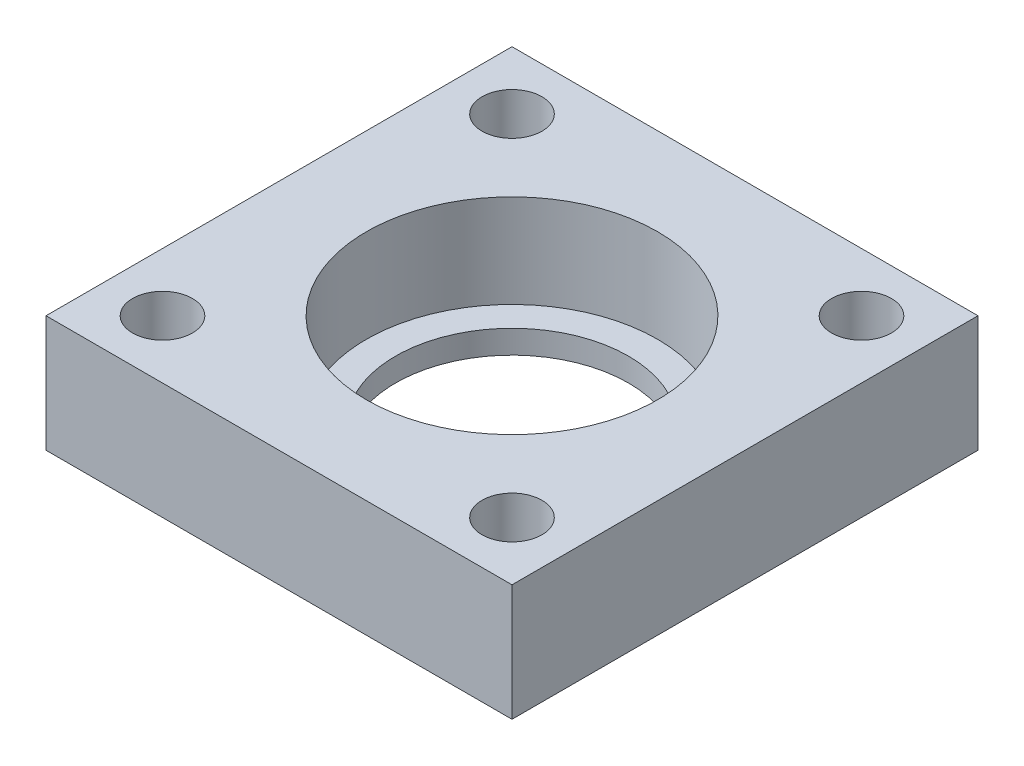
from build123d import *

# Parameters (mm, degrees)
SKETCH1_W         = 25.4
SKETCH1_H         = 25.4
EXTRUDE1_DEPTH    = 6.35
SKETCH2_R         = 7.9375
EXTRUDE2_DEPTH    = 5.08
SKETCH3_R         = 6.35
EXTRUDE3_DEPTH    = 1.27
CIRPATTERN1_COUNT = 4


with BuildPart() as part:
    # Sketch1 → Extrude1 (new body)
    with BuildSketch(Plane(origin=(0, 0, 0), x_dir=(1, 0, 0), z_dir=(0, 1, 0))):
        with Locations((12.7, 12.7)):
            Rectangle(SKETCH1_W, SKETCH1_H)
    extrude(amount=-EXTRUDE1_DEPTH)

    # Sketch2 → Extrude2 (cut)
    with BuildSketch(Plane(origin=(0, 0, 0), x_dir=(-1, 0, 0), z_dir=(0, 1, 0))):
        with Locations(Location((-12.7, -12.7, 0), (0, 0, 90))):
            Circle(SKETCH2_R)
    extrude(amount=-EXTRUDE2_DEPTH, mode=Mode.SUBTRACT)

    # Sketch3 → Extrude3 (cut)
    with BuildSketch(Plane(origin=(0, -5.08, 0), x_dir=(-1, 0, 0), z_dir=(0, 1, 0))):
        with Locations(Location((-12.7, -12.7, 0), (0, 0, 90))):
            Circle(SKETCH3_R)
    extrude(amount=-EXTRUDE3_DEPTH, mode=Mode.SUBTRACT)

    # Sketch4 → 4 Clearance Hole1 (revolve, cut)
    with BuildSketch(Plane(origin=(3.175, 0, -22.225), x_dir=(0, 0, 1), z_dir=(1, 0, 0))):
        Polygon((0, 0), (0, 10.124574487), (1.63195, 9.144), (1.63195, 0), align=None)
    f_4_clearance_hole1 = revolve(axis=Axis((3.175, 6.35, -22.225), (0, -1, 0)), mode=Mode.SUBTRACT)

    # CirPattern1: 4 Clearance Hole1 ×4 about axis
    cirpattern1_axis = Axis((12.7, 0, -12.7), (0, 1, 0))
    for i in range(1, CIRPATTERN1_COUNT):
        add(f_4_clearance_hole1.rotate(cirpattern1_axis, i * 360 / CIRPATTERN1_COUNT), mode=Mode.SUBTRACT)


solid = part.part
